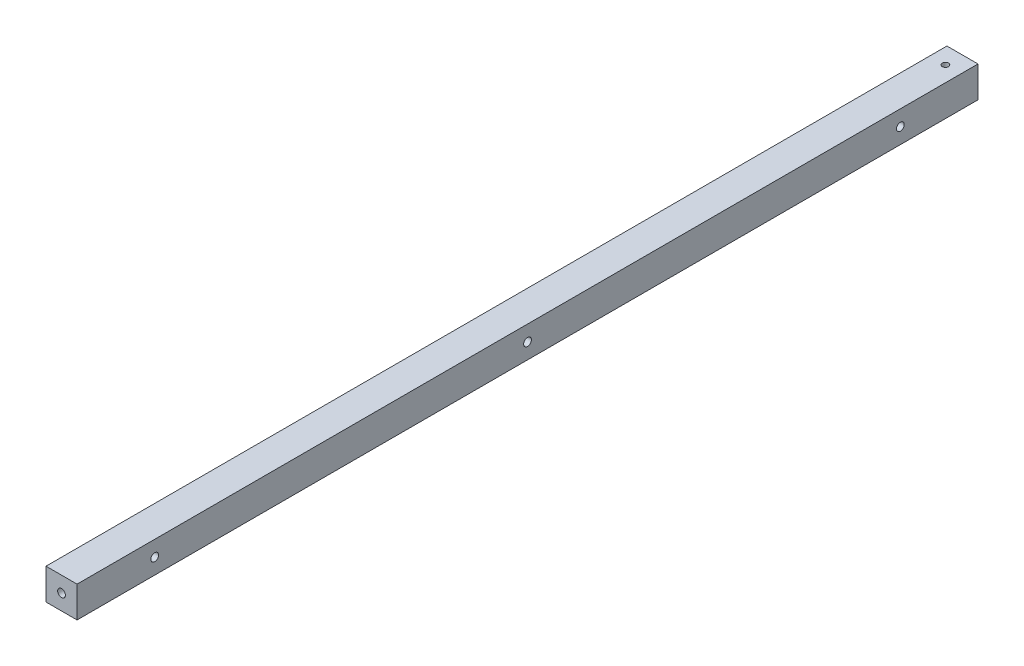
ISO-10303-21;
HEADER;
FILE_DESCRIPTION(('STEP AP214'),'2;1');
FILE_NAME('part.step','',(''),(''),'','','');
FILE_SCHEMA(('AUTOMOTIVE_DESIGN { 1 0 10303 214 1 1 1 1 }'));
ENDSEC;
DATA;
#1=APPLICATION_CONTEXT('core data for automotive mechanical design processes');
#2=APPLICATION_PROTOCOL_DEFINITION('international standard','automotive_design',2000,#1);
#3=PRODUCT_CONTEXT('',#1,'mechanical');
#4=PRODUCT('Part','Part','',(#3));
#5=PRODUCT_RELATED_PRODUCT_CATEGORY('part','',(#4));
#6=PRODUCT_DEFINITION_FORMATION('','',#4);
#7=PRODUCT_DEFINITION_CONTEXT('part definition',#1,'design');
#8=PRODUCT_DEFINITION('design','',#6,#7);
#9=PRODUCT_DEFINITION_SHAPE('','',#8);
#10=(LENGTH_UNIT() NAMED_UNIT(*) SI_UNIT(.MILLI.,.METRE.));
#11=(NAMED_UNIT(*) PLANE_ANGLE_UNIT() SI_UNIT($,.RADIAN.));
#12=(NAMED_UNIT(*) SI_UNIT($,.STERADIAN.) SOLID_ANGLE_UNIT());
#13=UNCERTAINTY_MEASURE_WITH_UNIT(LENGTH_MEASURE(1.E-05),#10,'distance_accuracy_value','');
#14=(GEOMETRIC_REPRESENTATION_CONTEXT(3) GLOBAL_UNCERTAINTY_ASSIGNED_CONTEXT((#13)) GLOBAL_UNIT_ASSIGNED_CONTEXT((#10,
#11,#12)) REPRESENTATION_CONTEXT('',''));
#15=CARTESIAN_POINT('',(0.,0.,0.));
#16=DIRECTION('',(0.,0.,1.));
#17=DIRECTION('',(1.,0.,0.));
#18=AXIS2_PLACEMENT_3D('',#15,#16,#17);
#19=CARTESIAN_POINT('',(-10.,10.,580.));
#20=DIRECTION('',(1.,0.,0.));
#21=DIRECTION('',(0.,0.,-1.));
#22=AXIS2_PLACEMENT_3D('',#19,#20,#21);
#23=PLANE('',#22);
#24=CARTESIAN_POINT('',(-10.,0.,50.));
#25=DIRECTION('',(1.,0.,0.));
#26=DIRECTION('',(0.,0.,-1.));
#27=AXIS2_PLACEMENT_3D('',#24,#25,#26);
#28=CIRCLE('',#27,2.5);
#29=CARTESIAN_POINT('',(-10.,0.,47.5));
#30=VERTEX_POINT('',#29);
#31=EDGE_CURVE('E109',#30,#30,#28,.T.);
#32=ORIENTED_EDGE('',*,*,#31,.T.);
#33=EDGE_LOOP('',(#32));
#34=FACE_BOUND('',#33,.T.);
#35=CARTESIAN_POINT('',(-10.,0.,290.));
#36=DIRECTION('',(1.,0.,0.));
#37=DIRECTION('',(0.,0.,-1.));
#38=AXIS2_PLACEMENT_3D('',#35,#36,#37);
#39=CIRCLE('',#38,2.5);
#40=CARTESIAN_POINT('',(-10.,0.,287.5));
#41=VERTEX_POINT('',#40);
#42=EDGE_CURVE('E118',#41,#41,#39,.T.);
#43=ORIENTED_EDGE('',*,*,#42,.T.);
#44=EDGE_LOOP('',(#43));
#45=FACE_BOUND('',#44,.T.);
#46=CARTESIAN_POINT('',(-10.,0.,530.));
#47=DIRECTION('',(1.,0.,0.));
#48=DIRECTION('',(0.,0.,-1.));
#49=AXIS2_PLACEMENT_3D('',#46,#47,#48);
#50=CIRCLE('',#49,2.5);
#51=CARTESIAN_POINT('',(-10.,0.,527.5));
#52=VERTEX_POINT('',#51);
#53=EDGE_CURVE('E126',#52,#52,#50,.T.);
#54=ORIENTED_EDGE('',*,*,#53,.T.);
#55=EDGE_LOOP('',(#54));
#56=FACE_BOUND('',#55,.T.);
#57=DIRECTION('',(0.,-1.,0.));
#58=VECTOR('',#57,1.);
#59=CARTESIAN_POINT('',(-10.,10.,0.));
#60=LINE('',#59,#58);
#61=CARTESIAN_POINT('',(-10.,10.,0.));
#62=VERTEX_POINT('',#61);
#63=CARTESIAN_POINT('',(-10.,-10.,0.));
#64=VERTEX_POINT('',#63);
#65=EDGE_CURVE('E151',#62,#64,#60,.T.);
#66=ORIENTED_EDGE('',*,*,#65,.T.);
#67=DIRECTION('',(0.,0.,-1.));
#68=VECTOR('',#67,1.);
#69=CARTESIAN_POINT('',(-10.,-10.,580.));
#70=LINE('',#69,#68);
#71=CARTESIAN_POINT('',(-10.,-10.,580.));
#72=VERTEX_POINT('',#71);
#73=EDGE_CURVE('E11',#72,#64,#70,.T.);
#74=ORIENTED_EDGE('',*,*,#73,.F.);
#75=DIRECTION('',(0.,-1.,0.));
#76=VECTOR('',#75,1.);
#77=CARTESIAN_POINT('',(-10.,10.,580.));
#78=LINE('',#77,#76);
#79=CARTESIAN_POINT('',(-10.,10.,580.));
#80=VERTEX_POINT('',#79);
#81=EDGE_CURVE('E163',#80,#72,#78,.T.);
#82=ORIENTED_EDGE('',*,*,#81,.F.);
#83=DIRECTION('',(0.,0.,-1.));
#84=VECTOR('',#83,1.);
#85=CARTESIAN_POINT('',(-10.,10.,580.));
#86=LINE('',#85,#84);
#87=EDGE_CURVE('E173',#80,#62,#86,.T.);
#88=ORIENTED_EDGE('',*,*,#87,.T.);
#89=EDGE_LOOP('',(#66,#74,#82,#88));
#90=FACE_BOUND('',#89,.T.);
#91=ADVANCED_FACE('F42',(#34,#45,#56,#90),#23,.F.);
#92=CARTESIAN_POINT('',(-10.,-10.,580.));
#93=DIRECTION('',(0.,1.,0.));
#94=DIRECTION('',(0.,0.,1.));
#95=AXIS2_PLACEMENT_3D('',#92,#93,#94);
#96=PLANE('',#95);
#97=CARTESIAN_POINT('',(0.,-10.,11.));
#98=DIRECTION('',(0.,-1.,0.));
#99=DIRECTION('',(0.,0.,-1.));
#100=AXIS2_PLACEMENT_3D('',#97,#98,#99);
#101=CIRCLE('',#100,2.);
#102=CARTESIAN_POINT('',(0.,-10.,9.));
#103=VERTEX_POINT('',#102);
#104=EDGE_CURVE('E138',#103,#103,#101,.T.);
#105=ORIENTED_EDGE('',*,*,#104,.F.);
#106=EDGE_LOOP('',(#105));
#107=FACE_BOUND('',#106,.T.);
#108=DIRECTION('',(1.,0.,0.));
#109=VECTOR('',#108,1.);
#110=CARTESIAN_POINT('',(-10.,-10.,0.));
#111=LINE('',#110,#109);
#112=CARTESIAN_POINT('',(10.,-10.,0.));
#113=VERTEX_POINT('',#112);
#114=EDGE_CURVE('E155',#64,#113,#111,.T.);
#115=ORIENTED_EDGE('',*,*,#114,.T.);
#116=DIRECTION('',(0.,0.,-1.));
#117=VECTOR('',#116,1.);
#118=CARTESIAN_POINT('',(10.,-10.,580.));
#119=LINE('',#118,#117);
#120=CARTESIAN_POINT('',(10.,-10.,580.));
#121=VERTEX_POINT('',#120);
#122=EDGE_CURVE('E55',#121,#113,#119,.T.);
#123=ORIENTED_EDGE('',*,*,#122,.F.);
#124=DIRECTION('',(1.,0.,0.));
#125=VECTOR('',#124,1.);
#126=CARTESIAN_POINT('',(-10.,-10.,580.));
#127=LINE('',#126,#125);
#128=EDGE_CURVE('E166',#72,#121,#127,.T.);
#129=ORIENTED_EDGE('',*,*,#128,.F.);
#130=ORIENTED_EDGE('',*,*,#73,.T.);
#131=EDGE_LOOP('',(#115,#123,#129,#130));
#132=FACE_BOUND('',#131,.T.);
#133=ADVANCED_FACE('F212',(#107,#132),#96,.F.);
#134=CARTESIAN_POINT('',(10.,10.,580.));
#135=DIRECTION('',(-1.,0.,0.));
#136=DIRECTION('',(0.,-1.,0.));
#137=AXIS2_PLACEMENT_3D('',#134,#135,#136);
#138=PLANE('',#137);
#139=CARTESIAN_POINT('',(10.,0.,50.));
#140=DIRECTION('',(1.,0.,0.));
#141=DIRECTION('',(0.,0.,-1.));
#142=AXIS2_PLACEMENT_3D('',#139,#140,#141);
#143=CIRCLE('',#142,2.49999999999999);
#144=CARTESIAN_POINT('',(10.,0.,47.5));
#145=VERTEX_POINT('',#144);
#146=EDGE_CURVE('E114',#145,#145,#143,.T.);
#147=ORIENTED_EDGE('',*,*,#146,.F.);
#148=EDGE_LOOP('',(#147));
#149=FACE_BOUND('',#148,.T.);
#150=CARTESIAN_POINT('',(10.,0.,290.));
#151=DIRECTION('',(1.,0.,0.));
#152=DIRECTION('',(0.,0.,-1.));
#153=AXIS2_PLACEMENT_3D('',#150,#151,#152);
#154=CIRCLE('',#153,2.49999999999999);
#155=CARTESIAN_POINT('',(10.,0.,287.5));
#156=VERTEX_POINT('',#155);
#157=EDGE_CURVE('E122',#156,#156,#154,.T.);
#158=ORIENTED_EDGE('',*,*,#157,.F.);
#159=EDGE_LOOP('',(#158));
#160=FACE_BOUND('',#159,.T.);
#161=CARTESIAN_POINT('',(10.,0.,530.));
#162=DIRECTION('',(1.,0.,0.));
#163=DIRECTION('',(0.,0.,-1.));
#164=AXIS2_PLACEMENT_3D('',#161,#162,#163);
#165=CIRCLE('',#164,2.49999999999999);
#166=CARTESIAN_POINT('',(10.,0.,527.5));
#167=VERTEX_POINT('',#166);
#168=EDGE_CURVE('E130',#167,#167,#165,.T.);
#169=ORIENTED_EDGE('',*,*,#168,.F.);
#170=EDGE_LOOP('',(#169));
#171=FACE_BOUND('',#170,.T.);
#172=DIRECTION('',(0.,1.,0.));
#173=VECTOR('',#172,1.);
#174=CARTESIAN_POINT('',(10.,10.,0.));
#175=LINE('',#174,#173);
#176=CARTESIAN_POINT('',(10.,10.,0.));
#177=VERTEX_POINT('',#176);
#178=EDGE_CURVE('E158',#113,#177,#175,.T.);
#179=ORIENTED_EDGE('',*,*,#178,.T.);
#180=DIRECTION('',(0.,0.,-1.));
#181=VECTOR('',#180,1.);
#182=CARTESIAN_POINT('',(10.,10.,580.));
#183=LINE('',#182,#181);
#184=CARTESIAN_POINT('',(10.,10.,580.));
#185=VERTEX_POINT('',#184);
#186=EDGE_CURVE('E177',#185,#177,#183,.T.);
#187=ORIENTED_EDGE('',*,*,#186,.F.);
#188=DIRECTION('',(0.,1.,0.));
#189=VECTOR('',#188,1.);
#190=CARTESIAN_POINT('',(10.,10.,580.));
#191=LINE('',#190,#189);
#192=EDGE_CURVE('E68',#121,#185,#191,.T.);
#193=ORIENTED_EDGE('',*,*,#192,.F.);
#194=ORIENTED_EDGE('',*,*,#122,.T.);
#195=EDGE_LOOP('',(#179,#187,#193,#194));
#196=FACE_BOUND('',#195,.T.);
#197=ADVANCED_FACE('F217',(#149,#160,#171,#196),#138,.F.);
#198=CARTESIAN_POINT('',(-10.,10.,580.));
#199=DIRECTION('',(0.,-1.,0.));
#200=DIRECTION('',(0.,0.,-1.));
#201=AXIS2_PLACEMENT_3D('',#198,#199,#200);
#202=PLANE('',#201);
#203=CARTESIAN_POINT('',(0.,10.,11.));
#204=DIRECTION('',(0.,-1.,0.));
#205=DIRECTION('',(0.,0.,-1.));
#206=AXIS2_PLACEMENT_3D('',#203,#204,#205);
#207=CIRCLE('',#206,2.);
#208=CARTESIAN_POINT('',(0.,10.,9.00000000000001));
#209=VERTEX_POINT('',#208);
#210=EDGE_CURVE('E134',#209,#209,#207,.T.);
#211=ORIENTED_EDGE('',*,*,#210,.T.);
#212=EDGE_LOOP('',(#211));
#213=FACE_BOUND('',#212,.T.);
#214=DIRECTION('',(-1.,0.,0.));
#215=VECTOR('',#214,1.);
#216=CARTESIAN_POINT('',(-10.,10.,0.));
#217=LINE('',#216,#215);
#218=EDGE_CURVE('E161',#177,#62,#217,.T.);
#219=ORIENTED_EDGE('',*,*,#218,.T.);
#220=ORIENTED_EDGE('',*,*,#87,.F.);
#221=DIRECTION('',(-1.,0.,0.));
#222=VECTOR('',#221,1.);
#223=CARTESIAN_POINT('',(-10.,10.,580.));
#224=LINE('',#223,#222);
#225=EDGE_CURVE('E63',#185,#80,#224,.T.);
#226=ORIENTED_EDGE('',*,*,#225,.F.);
#227=ORIENTED_EDGE('',*,*,#186,.T.);
#228=EDGE_LOOP('',(#219,#220,#226,#227));
#229=FACE_BOUND('',#228,.T.);
#230=ADVANCED_FACE('F235',(#213,#229),#202,.F.);
#231=CARTESIAN_POINT('',(-10.,-10.,580.));
#232=DIRECTION('',(0.,0.,1.));
#233=DIRECTION('',(1.,0.,0.));
#234=AXIS2_PLACEMENT_3D('',#231,#232,#233);
#235=PLANE('',#234);
#236=CARTESIAN_POINT('',(0.,0.,580.));
#237=DIRECTION('',(0.,0.,1.));
#238=DIRECTION('',(1.,0.,0.));
#239=AXIS2_PLACEMENT_3D('',#236,#237,#238);
#240=CIRCLE('',#239,2.49999999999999);
#241=CARTESIAN_POINT('',(2.49999999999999,0.,580.));
#242=VERTEX_POINT('',#241);
#243=EDGE_CURVE('E103',#242,#242,#240,.T.);
#244=ORIENTED_EDGE('',*,*,#243,.F.);
#245=EDGE_LOOP('',(#244));
#246=FACE_BOUND('',#245,.T.);
#247=ORIENTED_EDGE('',*,*,#81,.T.);
#248=ORIENTED_EDGE('',*,*,#128,.T.);
#249=ORIENTED_EDGE('',*,*,#192,.T.);
#250=ORIENTED_EDGE('',*,*,#225,.T.);
#251=EDGE_LOOP('',(#247,#248,#249,#250));
#252=FACE_BOUND('',#251,.T.);
#253=ADVANCED_FACE('F233',(#246,#252),#235,.T.);
#254=CARTESIAN_POINT('',(-10.,-10.,0.));
#255=DIRECTION('',(0.,0.,1.));
#256=DIRECTION('',(1.,0.,0.));
#257=AXIS2_PLACEMENT_3D('',#254,#255,#256);
#258=PLANE('',#257);
#259=CARTESIAN_POINT('',(0.,0.,0.));
#260=DIRECTION('',(0.,0.,-1.));
#261=DIRECTION('',(-1.,0.,0.));
#262=AXIS2_PLACEMENT_3D('',#259,#260,#261);
#263=CIRCLE('',#262,6.24999999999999);
#264=CARTESIAN_POINT('',(-6.24999999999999,0.,0.));
#265=VERTEX_POINT('',#264);
#266=EDGE_CURVE('E147',#265,#265,#263,.T.);
#267=ORIENTED_EDGE('',*,*,#266,.F.);
#268=EDGE_LOOP('',(#267));
#269=FACE_BOUND('',#268,.T.);
#270=ORIENTED_EDGE('',*,*,#65,.F.);
#271=ORIENTED_EDGE('',*,*,#218,.F.);
#272=ORIENTED_EDGE('',*,*,#178,.F.);
#273=ORIENTED_EDGE('',*,*,#114,.F.);
#274=EDGE_LOOP('',(#270,#271,#272,#273));
#275=FACE_BOUND('',#274,.T.);
#276=ADVANCED_FACE('F208',(#269,#275),#258,.F.);
#277=CARTESIAN_POINT('',(0.,0.,0.));
#278=DIRECTION('',(0.,0.,-1.));
#279=DIRECTION('',(-1.,0.,0.));
#280=AXIS2_PLACEMENT_3D('',#277,#278,#279);
#281=CYLINDRICAL_SURFACE('',#280,6.24999999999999);
#282=CARTESIAN_POINT('',(0.,6.24999999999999,9.));
#283=CARTESIAN_POINT('',(-0.109369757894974,6.24999973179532,9.00000030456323));
#284=CARTESIAN_POINT('',(-0.218743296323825,6.24710230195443,9.00900074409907));
#285=CARTESIAN_POINT('',(-0.434283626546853,6.23582827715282,9.04466477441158));
#286=CARTESIAN_POINT('',(-0.540449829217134,6.22745068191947,9.07133158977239));
#287=CARTESIAN_POINT('',(-0.746436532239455,6.20612979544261,9.14133115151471));
#288=CARTESIAN_POINT('',(-0.846266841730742,6.19319377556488,9.18463736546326));
#289=CARTESIAN_POINT('',(-1.03724845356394,6.16408627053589,9.28657103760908));
#290=CARTESIAN_POINT('',(-1.12839825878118,6.14791422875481,9.34520113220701));
#291=CARTESIAN_POINT('',(-1.30236844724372,6.1134633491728,9.47810514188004));
#292=CARTESIAN_POINT('',(-1.384870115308,6.09513697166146,9.55278387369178));
#293=CARTESIAN_POINT('',(-1.53641779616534,6.05871332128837,9.71480383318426));
#294=CARTESIAN_POINT('',(-1.60546114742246,6.0406160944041,9.80214755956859));
#295=CARTESIAN_POINT('',(-1.72989243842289,6.00618513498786,9.98981606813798));
#296=CARTESIAN_POINT('',(-1.78487653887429,5.9899098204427,10.0904203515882));
#297=CARTESIAN_POINT('',(-1.87701146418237,5.96168322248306,10.3000529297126));
#298=CARTESIAN_POINT('',(-1.91416724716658,5.94973073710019,10.4090788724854));
#299=CARTESIAN_POINT('',(-1.96841417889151,5.93200153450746,10.6288532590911));
#300=CARTESIAN_POINT('',(-1.98609871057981,5.92604268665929,10.73944012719));
#301=CARTESIAN_POINT('',(-2.00275541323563,5.92043538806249,10.9621594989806));
#302=CARTESIAN_POINT('',(-2.0017328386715,5.92078516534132,11.074291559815));
#303=CARTESIAN_POINT('',(-1.98146725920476,5.92759523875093,11.2919569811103));
#304=CARTESIAN_POINT('',(-1.96298552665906,5.93380021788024,11.3975705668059));
#305=CARTESIAN_POINT('',(-1.90956323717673,5.95120571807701,11.6041110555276));
#306=CARTESIAN_POINT('',(-1.87462085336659,5.9624067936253,11.7050374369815));
#307=CARTESIAN_POINT('',(-1.78874556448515,5.98873317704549,11.9011223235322));
#308=CARTESIAN_POINT('',(-1.73757841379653,6.00391536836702,11.9961702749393));
#309=CARTESIAN_POINT('',(-1.62086867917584,6.03646806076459,12.1765775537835));
#310=CARTESIAN_POINT('',(-1.55532221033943,6.05383915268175,12.2619342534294));
#311=CARTESIAN_POINT('',(-1.40800689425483,6.08982965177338,12.4248308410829));
#312=CARTESIAN_POINT('',(-1.32561170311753,6.10846901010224,12.5018009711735));
#313=CARTESIAN_POINT('',(-1.14885179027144,6.14416460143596,12.6409733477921));
#314=CARTESIAN_POINT('',(-1.05448609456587,6.16122070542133,12.7031743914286));
#315=CARTESIAN_POINT('',(-0.855326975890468,6.19202237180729,12.8114543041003));
#316=CARTESIAN_POINT('',(-0.750451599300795,6.20573850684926,12.8573913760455));
#317=CARTESIAN_POINT('',(-0.533919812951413,6.22810201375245,12.9307994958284));
#318=CARTESIAN_POINT('',(-0.422265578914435,6.23675100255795,12.9582764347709));
#319=CARTESIAN_POINT('',(-0.200177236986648,6.24774280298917,12.9930000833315));
#320=CARTESIAN_POINT('',(-0.0898753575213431,6.25032575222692,13.0010175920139));
#321=CARTESIAN_POINT('',(0.130512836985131,6.24960819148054,12.9987759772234));
#322=CARTESIAN_POINT('',(0.240599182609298,6.24630858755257,12.9885196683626));
#323=CARTESIAN_POINT('',(0.454418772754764,6.2343547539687,12.9506373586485));
#324=CARTESIAN_POINT('',(0.558242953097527,6.22584358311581,12.9234751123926));
#325=CARTESIAN_POINT('',(0.759827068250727,6.20446982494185,12.8531227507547));
#326=CARTESIAN_POINT('',(0.857586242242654,6.19160669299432,12.8099306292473));
#327=CARTESIAN_POINT('',(1.04699615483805,6.1624441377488,12.7075362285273));
#328=CARTESIAN_POINT('',(1.13843202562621,6.14606657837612,12.6479593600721));
#329=CARTESIAN_POINT('',(1.31026437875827,6.11174260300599,12.514932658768));
#330=CARTESIAN_POINT('',(1.39065771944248,6.09379574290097,12.4414788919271));
#331=CARTESIAN_POINT('',(1.54160401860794,6.05741209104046,12.2791573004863));
#332=CARTESIAN_POINT('',(1.61160724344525,6.03898605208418,12.1897746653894));
#333=CARTESIAN_POINT('',(1.73567677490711,6.0045055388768,12.0001316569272));
#334=CARTESIAN_POINT('',(1.78974321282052,5.98845104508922,11.8998713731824));
#335=CARTESIAN_POINT('',(1.88009475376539,5.96070328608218,11.6914455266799));
#336=CARTESIAN_POINT('',(1.91643832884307,5.94899571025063,11.5833073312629));
#337=CARTESIAN_POINT('',(1.97025835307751,5.93139102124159,11.3619909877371));
#338=CARTESIAN_POINT('',(1.98774243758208,5.92549155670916,11.24881489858));
#339=CARTESIAN_POINT('',(2.00278169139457,5.92042409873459,11.026405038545));
#340=CARTESIAN_POINT('',(2.00124235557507,5.92095023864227,10.9172387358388));
#341=CARTESIAN_POINT('',(1.98047943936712,5.92792698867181,10.7008037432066));
#342=CARTESIAN_POINT('',(1.96125676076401,5.93437729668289,10.5935349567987));
#343=CARTESIAN_POINT('',(1.90629165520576,5.95225678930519,10.3856457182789));
#344=CARTESIAN_POINT('',(1.87082034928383,5.96360409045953,10.2849460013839));
#345=CARTESIAN_POINT('',(1.78458034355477,5.98997469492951,10.090847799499));
#346=CARTESIAN_POINT('',(1.73380842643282,6.00499877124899,9.99745085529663));
#347=CARTESIAN_POINT('',(1.6159908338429,6.03779367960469,9.81648796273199));
#348=CARTESIAN_POINT('',(1.54836635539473,6.05565148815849,9.72931467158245));
#349=CARTESIAN_POINT('',(1.39976749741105,6.09171476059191,9.5672603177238));
#350=CARTESIAN_POINT('',(1.31878947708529,6.10992031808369,9.4923826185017));
#351=CARTESIAN_POINT('',(1.14239026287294,6.14538885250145,9.35442714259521));
#352=CARTESIAN_POINT('',(1.04656418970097,6.16259689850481,9.29185131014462));
#353=CARTESIAN_POINT('',(0.845204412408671,6.19342234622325,9.18377476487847));
#354=CARTESIAN_POINT('',(0.739674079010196,6.20704098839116,9.13826815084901));
#355=CARTESIAN_POINT('',(0.529579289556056,6.22835426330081,9.06844027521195));
#356=CARTESIAN_POINT('',(0.425470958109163,6.23639876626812,9.04285193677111));
#357=CARTESIAN_POINT('',(0.214242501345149,6.24722116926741,9.00863357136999));
#358=CARTESIAN_POINT('',(0.107123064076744,6.25000026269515,8.99999970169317));
#359=CARTESIAN_POINT('',(0.,6.24999999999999,9.));
#360=B_SPLINE_CURVE_WITH_KNOTS('',3,(#282,#283,#284,#285,#286,#287,#288,#289,#290,#291,#292,
#293,#294,#295,#296,#297,#298,#299,#300,#301,#302,#303,#304,#305,#306,#307,#308,#309,#310,#311,
#312,#313,#314,#315,#316,#317,#318,#319,#320,#321,#322,#323,#324,#325,#326,#327,#328,#329,#330,
#331,#332,#333,#334,#335,#336,#337,#338,#339,#340,#341,#342,#343,#344,#345,#346,#347,#348,#349,
#350,#351,#352,#353,#354,#355,#356,#357,#358,#359),.UNSPECIFIED.,.T.,.F.,(4,2,2,2,2,2,2,2,2,2,2,
2,2,2,2,2,2,2,2,2,2,2,2,2,2,2,2,2,2,2,2,2,2,2,2,2,2,2,4),(0.,0.327715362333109,
0.655490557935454,0.982745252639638,1.31005628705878,1.64687147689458,1.98375320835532,
2.32943536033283,2.67502132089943,3.00975612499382,3.34439690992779,3.66508861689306,
3.98581592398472,4.31140244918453,4.63707704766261,4.97834106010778,5.31963285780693,
5.66383089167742,6.00791903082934,6.33813763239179,6.66830537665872,6.98979270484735,
7.31132028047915,7.6409169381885,7.97060717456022,8.31403741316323,8.65746482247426,
8.99975138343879,9.34189931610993,9.66782668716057,9.99373743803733,10.3143977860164,
10.6351256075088,10.968921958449,11.3028094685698,11.6483285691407,11.9937281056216,
12.3147842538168,12.6357676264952),.UNSPECIFIED.);
#361=CARTESIAN_POINT('',(0.,6.24999999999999,9.));
#362=VERTEX_POINT('',#361);
#363=EDGE_CURVE('E45',#362,#362,#360,.T.);
#364=ORIENTED_EDGE('',*,*,#363,.T.);
#365=EDGE_LOOP('',(#364));
#366=FACE_BOUND('',#365,.T.);
#367=CARTESIAN_POINT('',(0.,-6.24999999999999,9.));
#368=CARTESIAN_POINT('',(0.109369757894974,-6.24999973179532,9.00000030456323));
#369=CARTESIAN_POINT('',(0.218743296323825,-6.24710230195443,9.00900074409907));
#370=CARTESIAN_POINT('',(0.434283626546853,-6.23582827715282,9.04466477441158));
#371=CARTESIAN_POINT('',(0.540449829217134,-6.22745068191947,9.07133158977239));
#372=CARTESIAN_POINT('',(0.746436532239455,-6.20612979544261,9.14133115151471));
#373=CARTESIAN_POINT('',(0.846266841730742,-6.19319377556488,9.18463736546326));
#374=CARTESIAN_POINT('',(1.03724845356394,-6.16408627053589,9.28657103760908));
#375=CARTESIAN_POINT('',(1.12839825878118,-6.14791422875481,9.34520113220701));
#376=CARTESIAN_POINT('',(1.30236844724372,-6.1134633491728,9.47810514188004));
#377=CARTESIAN_POINT('',(1.384870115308,-6.09513697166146,9.55278387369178));
#378=CARTESIAN_POINT('',(1.53641779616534,-6.05871332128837,9.71480383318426));
#379=CARTESIAN_POINT('',(1.60546114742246,-6.0406160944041,9.80214755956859));
#380=CARTESIAN_POINT('',(1.72989243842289,-6.00618513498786,9.98981606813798));
#381=CARTESIAN_POINT('',(1.78487653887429,-5.9899098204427,10.0904203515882));
#382=CARTESIAN_POINT('',(1.87701146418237,-5.96168322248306,10.3000529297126));
#383=CARTESIAN_POINT('',(1.91416724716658,-5.94973073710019,10.4090788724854));
#384=CARTESIAN_POINT('',(1.96841417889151,-5.93200153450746,10.6288532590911));
#385=CARTESIAN_POINT('',(1.98609871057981,-5.92604268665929,10.73944012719));
#386=CARTESIAN_POINT('',(2.00275541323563,-5.92043538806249,10.9621594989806));
#387=CARTESIAN_POINT('',(2.0017328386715,-5.92078516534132,11.074291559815));
#388=CARTESIAN_POINT('',(1.98146725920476,-5.92759523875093,11.2919569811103));
#389=CARTESIAN_POINT('',(1.96298552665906,-5.93380021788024,11.3975705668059));
#390=CARTESIAN_POINT('',(1.90956323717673,-5.95120571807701,11.6041110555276));
#391=CARTESIAN_POINT('',(1.87462085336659,-5.9624067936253,11.7050374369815));
#392=CARTESIAN_POINT('',(1.78874556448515,-5.98873317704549,11.9011223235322));
#393=CARTESIAN_POINT('',(1.73757841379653,-6.00391536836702,11.9961702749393));
#394=CARTESIAN_POINT('',(1.62086867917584,-6.03646806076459,12.1765775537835));
#395=CARTESIAN_POINT('',(1.55532221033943,-6.05383915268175,12.2619342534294));
#396=CARTESIAN_POINT('',(1.40800689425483,-6.08982965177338,12.4248308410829));
#397=CARTESIAN_POINT('',(1.32561170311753,-6.10846901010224,12.5018009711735));
#398=CARTESIAN_POINT('',(1.14885179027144,-6.14416460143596,12.6409733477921));
#399=CARTESIAN_POINT('',(1.05448609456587,-6.16122070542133,12.7031743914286));
#400=CARTESIAN_POINT('',(0.855326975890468,-6.19202237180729,12.8114543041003));
#401=CARTESIAN_POINT('',(0.750451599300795,-6.20573850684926,12.8573913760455));
#402=CARTESIAN_POINT('',(0.533919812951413,-6.22810201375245,12.9307994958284));
#403=CARTESIAN_POINT('',(0.422265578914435,-6.23675100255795,12.9582764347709));
#404=CARTESIAN_POINT('',(0.200177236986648,-6.24774280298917,12.9930000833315));
#405=CARTESIAN_POINT('',(0.0898753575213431,-6.25032575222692,13.0010175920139));
#406=CARTESIAN_POINT('',(-0.130512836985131,-6.24960819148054,12.9987759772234));
#407=CARTESIAN_POINT('',(-0.240599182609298,-6.24630858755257,12.9885196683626));
#408=CARTESIAN_POINT('',(-0.454418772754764,-6.2343547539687,12.9506373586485));
#409=CARTESIAN_POINT('',(-0.558242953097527,-6.22584358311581,12.9234751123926));
#410=CARTESIAN_POINT('',(-0.759827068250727,-6.20446982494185,12.8531227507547));
#411=CARTESIAN_POINT('',(-0.857586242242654,-6.19160669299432,12.8099306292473));
#412=CARTESIAN_POINT('',(-1.04699615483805,-6.1624441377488,12.7075362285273));
#413=CARTESIAN_POINT('',(-1.13843202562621,-6.14606657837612,12.6479593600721));
#414=CARTESIAN_POINT('',(-1.31026437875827,-6.11174260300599,12.514932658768));
#415=CARTESIAN_POINT('',(-1.39065771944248,-6.09379574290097,12.4414788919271));
#416=CARTESIAN_POINT('',(-1.54160401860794,-6.05741209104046,12.2791573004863));
#417=CARTESIAN_POINT('',(-1.61160724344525,-6.03898605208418,12.1897746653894));
#418=CARTESIAN_POINT('',(-1.73567677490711,-6.0045055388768,12.0001316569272));
#419=CARTESIAN_POINT('',(-1.78974321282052,-5.98845104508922,11.8998713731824));
#420=CARTESIAN_POINT('',(-1.88009475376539,-5.96070328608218,11.6914455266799));
#421=CARTESIAN_POINT('',(-1.91643832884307,-5.94899571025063,11.5833073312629));
#422=CARTESIAN_POINT('',(-1.97025835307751,-5.93139102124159,11.3619909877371));
#423=CARTESIAN_POINT('',(-1.98774243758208,-5.92549155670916,11.24881489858));
#424=CARTESIAN_POINT('',(-2.00278169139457,-5.92042409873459,11.026405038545));
#425=CARTESIAN_POINT('',(-2.00124235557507,-5.92095023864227,10.9172387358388));
#426=CARTESIAN_POINT('',(-1.98047943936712,-5.92792698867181,10.7008037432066));
#427=CARTESIAN_POINT('',(-1.96125676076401,-5.93437729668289,10.5935349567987));
#428=CARTESIAN_POINT('',(-1.90629165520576,-5.95225678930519,10.3856457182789));
#429=CARTESIAN_POINT('',(-1.87082034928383,-5.96360409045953,10.2849460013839));
#430=CARTESIAN_POINT('',(-1.78458034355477,-5.98997469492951,10.090847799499));
#431=CARTESIAN_POINT('',(-1.73380842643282,-6.00499877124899,9.99745085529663));
#432=CARTESIAN_POINT('',(-1.6159908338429,-6.03779367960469,9.81648796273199));
#433=CARTESIAN_POINT('',(-1.54836635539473,-6.05565148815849,9.72931467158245));
#434=CARTESIAN_POINT('',(-1.39976749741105,-6.09171476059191,9.5672603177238));
#435=CARTESIAN_POINT('',(-1.31878947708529,-6.10992031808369,9.4923826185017));
#436=CARTESIAN_POINT('',(-1.14239026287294,-6.14538885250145,9.35442714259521));
#437=CARTESIAN_POINT('',(-1.04656418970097,-6.16259689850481,9.29185131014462));
#438=CARTESIAN_POINT('',(-0.845204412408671,-6.19342234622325,9.18377476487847));
#439=CARTESIAN_POINT('',(-0.739674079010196,-6.20704098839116,9.13826815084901));
#440=CARTESIAN_POINT('',(-0.529579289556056,-6.22835426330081,9.06844027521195));
#441=CARTESIAN_POINT('',(-0.425470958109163,-6.23639876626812,9.04285193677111));
#442=CARTESIAN_POINT('',(-0.214242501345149,-6.24722116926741,9.00863357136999));
#443=CARTESIAN_POINT('',(-0.107123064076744,-6.25000026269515,8.99999970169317));
#444=CARTESIAN_POINT('',(0.,-6.24999999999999,9.));
#445=B_SPLINE_CURVE_WITH_KNOTS('',3,(#367,#368,#369,#370,#371,#372,#373,#374,#375,#376,#377,
#378,#379,#380,#381,#382,#383,#384,#385,#386,#387,#388,#389,#390,#391,#392,#393,#394,#395,#396,
#397,#398,#399,#400,#401,#402,#403,#404,#405,#406,#407,#408,#409,#410,#411,#412,#413,#414,#415,
#416,#417,#418,#419,#420,#421,#422,#423,#424,#425,#426,#427,#428,#429,#430,#431,#432,#433,#434,
#435,#436,#437,#438,#439,#440,#441,#442,#443,#444),.UNSPECIFIED.,.T.,.F.,(4,2,2,2,2,2,2,2,2,2,2,
2,2,2,2,2,2,2,2,2,2,2,2,2,2,2,2,2,2,2,2,2,2,2,2,2,2,2,4),(0.,0.327715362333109,
0.655490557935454,0.982745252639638,1.31005628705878,1.64687147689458,1.98375320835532,
2.32943536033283,2.67502132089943,3.00975612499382,3.34439690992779,3.66508861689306,
3.98581592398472,4.31140244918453,4.63707704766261,4.97834106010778,5.31963285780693,
5.66383089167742,6.00791903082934,6.33813763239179,6.66830537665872,6.98979270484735,
7.31132028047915,7.6409169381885,7.97060717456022,8.31403741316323,8.65746482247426,
8.99975138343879,9.34189931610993,9.66782668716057,9.99373743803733,10.3143977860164,
10.6351256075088,10.968921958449,11.3028094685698,11.6483285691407,11.9937281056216,
12.3147842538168,12.6357676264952),.UNSPECIFIED.);
#446=CARTESIAN_POINT('',(0.,-6.24999999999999,9.));
#447=VERTEX_POINT('',#446);
#448=EDGE_CURVE('E142',#447,#447,#445,.T.);
#449=ORIENTED_EDGE('',*,*,#448,.T.);
#450=EDGE_LOOP('',(#449));
#451=FACE_BOUND('',#450,.T.);
#452=CARTESIAN_POINT('',(0.,0.,20.));
#453=DIRECTION('',(0.,0.,-1.));
#454=DIRECTION('',(-1.,0.,0.));
#455=AXIS2_PLACEMENT_3D('',#452,#453,#454);
#456=CIRCLE('',#455,6.24999999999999);
#457=CARTESIAN_POINT('',(-6.24999999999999,0.,20.));
#458=VERTEX_POINT('',#457);
#459=EDGE_CURVE('E143',#458,#458,#456,.T.);
#460=ORIENTED_EDGE('',*,*,#459,.F.);
#461=EDGE_LOOP('',(#460));
#462=FACE_BOUND('',#461,.T.);
#463=ORIENTED_EDGE('',*,*,#266,.T.);
#464=EDGE_LOOP('',(#463));
#465=FACE_BOUND('',#464,.T.);
#466=ADVANCED_FACE('F187',(#366,#451,#462,#465),#281,.F.);
#467=CARTESIAN_POINT('',(0.,0.,20.));
#468=DIRECTION('',(0.,0.,-1.));
#469=DIRECTION('',(-1.,0.,0.));
#470=AXIS2_PLACEMENT_3D('',#467,#468,#469);
#471=CONICAL_SURFACE('',#470,6.24999999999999,1.02974425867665);
#472=CARTESIAN_POINT('',(0.,0.,23.7553788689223));
#473=VERTEX_POINT('',#472);
#474=VERTEX_LOOP('',#473);
#475=FACE_BOUND('',#474,.T.);
#476=ORIENTED_EDGE('',*,*,#459,.T.);
#477=EDGE_LOOP('',(#476));
#478=FACE_BOUND('',#477,.T.);
#479=ADVANCED_FACE('F199',(#475,#478),#471,.F.);
#480=CARTESIAN_POINT('',(0.,-10.,11.));
#481=DIRECTION('',(0.,-1.,0.));
#482=DIRECTION('',(0.,0.,-1.));
#483=AXIS2_PLACEMENT_3D('',#480,#481,#482);
#484=CYLINDRICAL_SURFACE('',#483,2.);
#485=ORIENTED_EDGE('',*,*,#104,.T.);
#486=EDGE_LOOP('',(#485));
#487=FACE_BOUND('',#486,.T.);
#488=ORIENTED_EDGE('',*,*,#448,.F.);
#489=EDGE_LOOP('',(#488));
#490=FACE_BOUND('',#489,.T.);
#491=ADVANCED_FACE('F196',(#487,#490),#484,.F.);
#492=ORIENTED_EDGE('',*,*,#210,.F.);
#493=EDGE_LOOP('',(#492));
#494=FACE_BOUND('',#493,.T.);
#495=ORIENTED_EDGE('',*,*,#363,.F.);
#496=EDGE_LOOP('',(#495));
#497=FACE_BOUND('',#496,.T.);
#498=ADVANCED_FACE('F191',(#494,#497),#484,.F.);
#499=CARTESIAN_POINT('',(10.,0.,530.));
#500=DIRECTION('',(1.,0.,0.));
#501=DIRECTION('',(0.,0.,-1.));
#502=AXIS2_PLACEMENT_3D('',#499,#500,#501);
#503=CYLINDRICAL_SURFACE('',#502,2.49999999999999);
#504=ORIENTED_EDGE('',*,*,#53,.F.);
#505=EDGE_LOOP('',(#504));
#506=FACE_BOUND('',#505,.T.);
#507=ORIENTED_EDGE('',*,*,#168,.T.);
#508=EDGE_LOOP('',(#507));
#509=FACE_BOUND('',#508,.T.);
#510=ADVANCED_FACE('F195',(#506,#509),#503,.F.);
#511=CARTESIAN_POINT('',(10.,0.,290.));
#512=DIRECTION('',(1.,0.,0.));
#513=DIRECTION('',(0.,0.,-1.));
#514=AXIS2_PLACEMENT_3D('',#511,#512,#513);
#515=CYLINDRICAL_SURFACE('',#514,2.49999999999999);
#516=ORIENTED_EDGE('',*,*,#42,.F.);
#517=EDGE_LOOP('',(#516));
#518=FACE_BOUND('',#517,.T.);
#519=ORIENTED_EDGE('',*,*,#157,.T.);
#520=EDGE_LOOP('',(#519));
#521=FACE_BOUND('',#520,.T.);
#522=ADVANCED_FACE('F260',(#518,#521),#515,.F.);
#523=CARTESIAN_POINT('',(10.,0.,50.));
#524=DIRECTION('',(1.,0.,0.));
#525=DIRECTION('',(0.,0.,-1.));
#526=AXIS2_PLACEMENT_3D('',#523,#524,#525);
#527=CYLINDRICAL_SURFACE('',#526,2.49999999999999);
#528=ORIENTED_EDGE('',*,*,#31,.F.);
#529=EDGE_LOOP('',(#528));
#530=FACE_BOUND('',#529,.T.);
#531=ORIENTED_EDGE('',*,*,#146,.T.);
#532=EDGE_LOOP('',(#531));
#533=FACE_BOUND('',#532,.T.);
#534=ADVANCED_FACE('F265',(#530,#533),#527,.F.);
#535=CARTESIAN_POINT('',(0.,0.,580.));
#536=DIRECTION('',(0.,0.,1.));
#537=DIRECTION('',(1.,0.,0.));
#538=AXIS2_PLACEMENT_3D('',#535,#536,#537);
#539=CYLINDRICAL_SURFACE('',#538,2.49999999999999);
#540=CARTESIAN_POINT('',(0.,0.,565.));
#541=DIRECTION('',(0.,0.,1.));
#542=DIRECTION('',(1.,0.,0.));
#543=AXIS2_PLACEMENT_3D('',#540,#541,#542);
#544=CIRCLE('',#543,2.49999999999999);
#545=CARTESIAN_POINT('',(2.49999999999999,0.,565.));
#546=VERTEX_POINT('',#545);
#547=EDGE_CURVE('E100',#546,#546,#544,.T.);
#548=ORIENTED_EDGE('',*,*,#547,.F.);
#549=EDGE_LOOP('',(#548));
#550=FACE_BOUND('',#549,.T.);
#551=ORIENTED_EDGE('',*,*,#243,.T.);
#552=EDGE_LOOP('',(#551));
#553=FACE_BOUND('',#552,.T.);
#554=ADVANCED_FACE('F96',(#550,#553),#539,.F.);
#555=CARTESIAN_POINT('',(0.,0.,565.));
#556=DIRECTION('',(0.,0.,1.));
#557=DIRECTION('',(1.,0.,0.));
#558=AXIS2_PLACEMENT_3D('',#555,#556,#557);
#559=CONICAL_SURFACE('',#558,2.49999999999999,1.02974425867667);
#560=CARTESIAN_POINT('',(0.,0.,563.497848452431));
#561=VERTEX_POINT('',#560);
#562=VERTEX_LOOP('',#561);
#563=FACE_BOUND('',#562,.T.);
#564=ORIENTED_EDGE('',*,*,#547,.T.);
#565=EDGE_LOOP('',(#564));
#566=FACE_BOUND('',#565,.T.);
#567=ADVANCED_FACE('F93',(#563,#566),#559,.F.);
#568=CLOSED_SHELL('',(#91,#133,#197,#230,#253,#276,#466,#479,#491,#498,#510,#522,#534,#554,#567));
#569=MANIFOLD_SOLID_BREP('B2',#568);
#570=ADVANCED_BREP_SHAPE_REPRESENTATION('',(#18,#569),#14);
#571=SHAPE_DEFINITION_REPRESENTATION(#9,#570);
ENDSEC;
END-ISO-10303-21;
